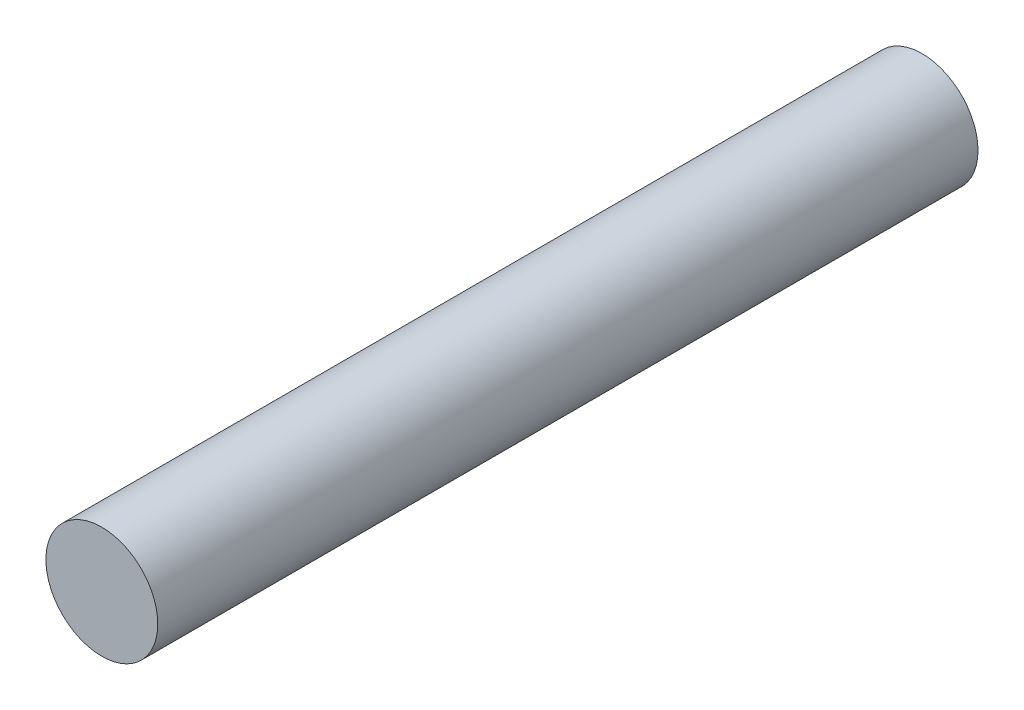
from build123d import *

# Parameters (mm, degrees)
ESQUISSE1_R      = 1.5
EXTRUSION1_DEPTH = 22


with BuildPart() as part:
    # Esquisse1 → Extrusion1 (new body)
    with BuildSketch(Plane.XY):
        Circle(ESQUISSE1_R)
    extrude(amount=EXTRUSION1_DEPTH)


solid = part.part
